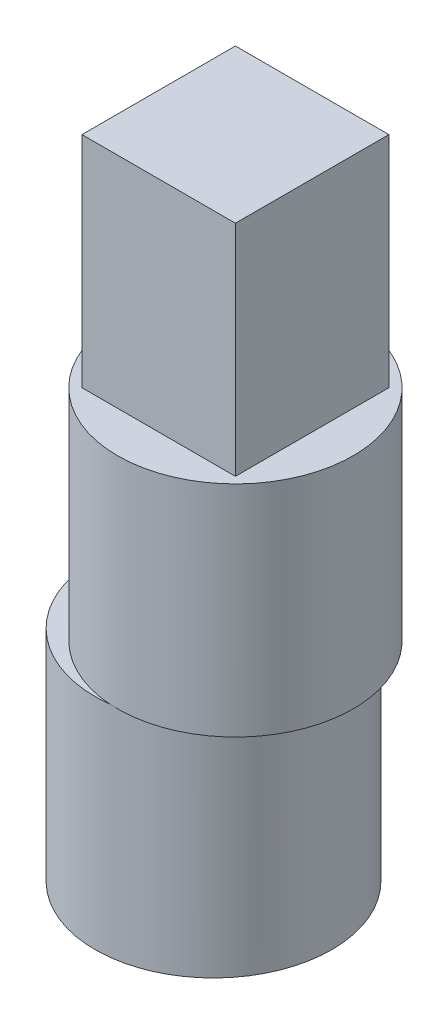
ISO-10303-21;
HEADER;
FILE_DESCRIPTION(('STEP AP214'),'2;1');
FILE_NAME('part.step','',(''),(''),'','','');
FILE_SCHEMA(('AUTOMOTIVE_DESIGN { 1 0 10303 214 1 1 1 1 }'));
ENDSEC;
DATA;
#1=APPLICATION_CONTEXT('core data for automotive mechanical design processes');
#2=APPLICATION_PROTOCOL_DEFINITION('international standard','automotive_design',2000,#1);
#3=PRODUCT_CONTEXT('',#1,'mechanical');
#4=PRODUCT('Part','Part','',(#3));
#5=PRODUCT_RELATED_PRODUCT_CATEGORY('part','',(#4));
#6=PRODUCT_DEFINITION_FORMATION('','',#4);
#7=PRODUCT_DEFINITION_CONTEXT('part definition',#1,'design');
#8=PRODUCT_DEFINITION('design','',#6,#7);
#9=PRODUCT_DEFINITION_SHAPE('','',#8);
#10=(LENGTH_UNIT() NAMED_UNIT(*) SI_UNIT(.MILLI.,.METRE.));
#11=(NAMED_UNIT(*) PLANE_ANGLE_UNIT() SI_UNIT($,.RADIAN.));
#12=(NAMED_UNIT(*) SI_UNIT($,.STERADIAN.) SOLID_ANGLE_UNIT());
#13=UNCERTAINTY_MEASURE_WITH_UNIT(LENGTH_MEASURE(1.E-05),#10,'distance_accuracy_value','');
#14=(GEOMETRIC_REPRESENTATION_CONTEXT(3) GLOBAL_UNCERTAINTY_ASSIGNED_CONTEXT((#13)) GLOBAL_UNIT_ASSIGNED_CONTEXT((#10,
#11,#12)) REPRESENTATION_CONTEXT('',''));
#15=CARTESIAN_POINT('',(0.,0.,0.));
#16=DIRECTION('',(0.,0.,1.));
#17=DIRECTION('',(1.,0.,0.));
#18=AXIS2_PLACEMENT_3D('',#15,#16,#17);
#19=CARTESIAN_POINT('',(0.,10.,0.));
#20=DIRECTION('',(0.,-1.,0.));
#21=DIRECTION('',(0.,0.,-1.));
#22=AXIS2_PLACEMENT_3D('',#19,#20,#21);
#23=CYLINDRICAL_SURFACE('',#22,5.375);
#24=CARTESIAN_POINT('',(0.,10.,0.));
#25=DIRECTION('',(0.,1.,0.));
#26=DIRECTION('',(0.,0.,1.));
#27=AXIS2_PLACEMENT_3D('',#24,#25,#26);
#28=CIRCLE('',#27,5.375);
#29=CARTESIAN_POINT('',(0.,10.,5.375));
#30=VERTEX_POINT('',#29);
#31=EDGE_CURVE('E11',#30,#30,#28,.T.);
#32=ORIENTED_EDGE('',*,*,#31,.F.);
#33=EDGE_LOOP('',(#32));
#34=FACE_BOUND('',#33,.T.);
#35=CARTESIAN_POINT('',(0.,0.,0.));
#36=DIRECTION('',(0.,1.,0.));
#37=DIRECTION('',(0.,0.,1.));
#38=AXIS2_PLACEMENT_3D('',#35,#36,#37);
#39=CIRCLE('',#38,5.375);
#40=CARTESIAN_POINT('',(-0.365312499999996,0.,-5.36257137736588));
#41=VERTEX_POINT('',#40);
#42=CARTESIAN_POINT('',(-0.365312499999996,0.,5.36257137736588));
#43=VERTEX_POINT('',#42);
#44=EDGE_CURVE('E46',#41,#43,#39,.T.);
#45=ORIENTED_EDGE('',*,*,#44,.T.);
#46=EDGE_CURVE('E127',#43,#41,#39,.T.);
#47=ORIENTED_EDGE('',*,*,#46,.T.);
#48=EDGE_LOOP('',(#45,#47));
#49=FACE_BOUND('',#48,.T.);
#50=ADVANCED_FACE('F43',(#34,#49),#23,.T.);
#51=CARTESIAN_POINT('',(0.,10.,0.));
#52=DIRECTION('',(0.,1.,0.));
#53=DIRECTION('',(0.,0.,1.));
#54=AXIS2_PLACEMENT_3D('',#51,#52,#53);
#55=PLANE('',#54);
#56=DIRECTION('',(0.,0.,1.));
#57=VECTOR('',#56,1.);
#58=CARTESIAN_POINT('',(-3.5,10.,-3.5));
#59=LINE('',#58,#57);
#60=CARTESIAN_POINT('',(-3.5,10.,-3.5));
#61=VERTEX_POINT('',#60);
#62=CARTESIAN_POINT('',(-3.5,10.,3.5));
#63=VERTEX_POINT('',#62);
#64=EDGE_CURVE('E58',#61,#63,#59,.T.);
#65=ORIENTED_EDGE('',*,*,#64,.F.);
#66=DIRECTION('',(-1.,0.,0.));
#67=VECTOR('',#66,1.);
#68=CARTESIAN_POINT('',(-3.5,10.,-3.5));
#69=LINE('',#68,#67);
#70=CARTESIAN_POINT('',(3.5,10.,-3.5));
#71=VERTEX_POINT('',#70);
#72=EDGE_CURVE('E62',#71,#61,#69,.T.);
#73=ORIENTED_EDGE('',*,*,#72,.F.);
#74=DIRECTION('',(0.,0.,-1.));
#75=VECTOR('',#74,1.);
#76=CARTESIAN_POINT('',(3.5,10.,-3.5));
#77=LINE('',#76,#75);
#78=CARTESIAN_POINT('',(3.5,10.,3.5));
#79=VERTEX_POINT('',#78);
#80=EDGE_CURVE('E267',#79,#71,#77,.T.);
#81=ORIENTED_EDGE('',*,*,#80,.F.);
#82=DIRECTION('',(1.,0.,0.));
#83=VECTOR('',#82,1.);
#84=CARTESIAN_POINT('',(-3.5,10.,3.5));
#85=LINE('',#84,#83);
#86=EDGE_CURVE('E277',#63,#79,#85,.T.);
#87=ORIENTED_EDGE('',*,*,#86,.F.);
#88=EDGE_LOOP('',(#65,#73,#81,#87));
#89=FACE_BOUND('',#88,.T.);
#90=ORIENTED_EDGE('',*,*,#31,.T.);
#91=EDGE_LOOP('',(#90));
#92=FACE_BOUND('',#91,.T.);
#93=ADVANCED_FACE('F155',(#89,#92),#55,.T.);
#94=CARTESIAN_POINT('',(0.,0.,0.));
#95=DIRECTION('',(0.,1.,0.));
#96=DIRECTION('',(0.,0.,1.));
#97=AXIS2_PLACEMENT_3D('',#94,#95,#96);
#98=PLANE('',#97);
#99=CARTESIAN_POINT('',(-1.,0.,0.));
#100=DIRECTION('',(0.,-1.,0.));
#101=DIRECTION('',(0.,0.,-1.));
#102=AXIS2_PLACEMENT_3D('',#99,#100,#101);
#103=CIRCLE('',#102,5.4);
#104=EDGE_CURVE('E118',#41,#43,#103,.T.);
#105=ORIENTED_EDGE('',*,*,#104,.F.);
#106=ORIENTED_EDGE('',*,*,#46,.F.);
#107=EDGE_LOOP('',(#105,#106));
#108=FACE_BOUND('',#107,.T.);
#109=ADVANCED_FACE('F136',(#108),#98,.F.);
#110=CARTESIAN_POINT('',(-1.,-10.,0.));
#111=DIRECTION('',(0.,1.,0.));
#112=DIRECTION('',(0.,0.,1.));
#113=AXIS2_PLACEMENT_3D('',#110,#111,#112);
#114=CYLINDRICAL_SURFACE('',#113,5.4);
#115=CARTESIAN_POINT('',(-1.,-10.,0.));
#116=DIRECTION('',(0.,-1.,0.));
#117=DIRECTION('',(0.,0.,-1.));
#118=AXIS2_PLACEMENT_3D('',#115,#116,#117);
#119=CIRCLE('',#118,5.4);
#120=CARTESIAN_POINT('',(-1.,-10.,-5.4));
#121=VERTEX_POINT('',#120);
#122=EDGE_CURVE('E124',#121,#121,#119,.T.);
#123=ORIENTED_EDGE('',*,*,#122,.F.);
#124=EDGE_LOOP('',(#123));
#125=FACE_BOUND('',#124,.T.);
#126=ORIENTED_EDGE('',*,*,#104,.T.);
#127=EDGE_CURVE('E113',#43,#41,#103,.T.);
#128=ORIENTED_EDGE('',*,*,#127,.T.);
#129=EDGE_LOOP('',(#126,#128));
#130=FACE_BOUND('',#129,.T.);
#131=ADVANCED_FACE('F131',(#125,#130),#114,.T.);
#132=CARTESIAN_POINT('',(-1.,-10.,0.));
#133=DIRECTION('',(0.,-1.,0.));
#134=DIRECTION('',(0.,0.,-1.));
#135=AXIS2_PLACEMENT_3D('',#132,#133,#134);
#136=PLANE('',#135);
#137=ORIENTED_EDGE('',*,*,#122,.T.);
#138=EDGE_LOOP('',(#137));
#139=FACE_BOUND('',#138,.T.);
#140=ADVANCED_FACE('F144',(#139),#136,.T.);
#141=CARTESIAN_POINT('',(-1.,0.,0.));
#142=DIRECTION('',(0.,-1.,0.));
#143=DIRECTION('',(0.,0.,-1.));
#144=AXIS2_PLACEMENT_3D('',#141,#142,#143);
#145=PLANE('',#144);
#146=ORIENTED_EDGE('',*,*,#44,.F.);
#147=ORIENTED_EDGE('',*,*,#127,.F.);
#148=EDGE_LOOP('',(#146,#147));
#149=FACE_BOUND('',#148,.T.);
#150=ADVANCED_FACE('F141',(#149),#145,.F.);
#151=CARTESIAN_POINT('',(-3.5,20.,-3.5));
#152=DIRECTION('',(1.,0.,0.));
#153=DIRECTION('',(0.,0.,-1.));
#154=AXIS2_PLACEMENT_3D('',#151,#152,#153);
#155=PLANE('',#154);
#156=ORIENTED_EDGE('',*,*,#64,.T.);
#157=DIRECTION('',(0.,-1.,0.));
#158=VECTOR('',#157,1.);
#159=CARTESIAN_POINT('',(-3.5,20.,3.5));
#160=LINE('',#159,#158);
#161=CARTESIAN_POINT('',(-3.5,20.,3.5));
#162=VERTEX_POINT('',#161);
#163=EDGE_CURVE('E93',#162,#63,#160,.T.);
#164=ORIENTED_EDGE('',*,*,#163,.F.);
#165=DIRECTION('',(0.,0.,1.));
#166=VECTOR('',#165,1.);
#167=CARTESIAN_POINT('',(-3.5,20.,-3.5));
#168=LINE('',#167,#166);
#169=CARTESIAN_POINT('',(-3.5,20.,-3.5));
#170=VERTEX_POINT('',#169);
#171=EDGE_CURVE('E100',#170,#162,#168,.T.);
#172=ORIENTED_EDGE('',*,*,#171,.F.);
#173=DIRECTION('',(0.,-1.,0.));
#174=VECTOR('',#173,1.);
#175=CARTESIAN_POINT('',(-3.5,20.,-3.5));
#176=LINE('',#175,#174);
#177=EDGE_CURVE('E264',#170,#61,#176,.T.);
#178=ORIENTED_EDGE('',*,*,#177,.T.);
#179=EDGE_LOOP('',(#156,#164,#172,#178));
#180=FACE_BOUND('',#179,.T.);
#181=ADVANCED_FACE('F111',(#180),#155,.F.);
#182=CARTESIAN_POINT('',(-3.5,20.,3.5));
#183=DIRECTION('',(0.,0.,-1.));
#184=DIRECTION('',(-1.,0.,0.));
#185=AXIS2_PLACEMENT_3D('',#182,#183,#184);
#186=PLANE('',#185);
#187=ORIENTED_EDGE('',*,*,#86,.T.);
#188=DIRECTION('',(0.,-1.,0.));
#189=VECTOR('',#188,1.);
#190=CARTESIAN_POINT('',(3.5,20.,3.5));
#191=LINE('',#190,#189);
#192=CARTESIAN_POINT('',(3.5,20.,3.5));
#193=VERTEX_POINT('',#192);
#194=EDGE_CURVE('E95',#193,#79,#191,.T.);
#195=ORIENTED_EDGE('',*,*,#194,.F.);
#196=DIRECTION('',(1.,0.,0.));
#197=VECTOR('',#196,1.);
#198=CARTESIAN_POINT('',(-3.5,20.,3.5));
#199=LINE('',#198,#197);
#200=EDGE_CURVE('E88',#162,#193,#199,.T.);
#201=ORIENTED_EDGE('',*,*,#200,.F.);
#202=ORIENTED_EDGE('',*,*,#163,.T.);
#203=EDGE_LOOP('',(#187,#195,#201,#202));
#204=FACE_BOUND('',#203,.T.);
#205=ADVANCED_FACE('F91',(#204),#186,.F.);
#206=CARTESIAN_POINT('',(3.5,20.,-3.5));
#207=DIRECTION('',(-1.,0.,0.));
#208=DIRECTION('',(0.,0.,1.));
#209=AXIS2_PLACEMENT_3D('',#206,#207,#208);
#210=PLANE('',#209);
#211=ORIENTED_EDGE('',*,*,#80,.T.);
#212=DIRECTION('',(0.,-1.,0.));
#213=VECTOR('',#212,1.);
#214=CARTESIAN_POINT('',(3.5,20.,-3.5));
#215=LINE('',#214,#213);
#216=CARTESIAN_POINT('',(3.5,20.,-3.5));
#217=VERTEX_POINT('',#216);
#218=EDGE_CURVE('E120',#217,#71,#215,.T.);
#219=ORIENTED_EDGE('',*,*,#218,.F.);
#220=DIRECTION('',(0.,0.,-1.));
#221=VECTOR('',#220,1.);
#222=CARTESIAN_POINT('',(3.5,20.,-3.5));
#223=LINE('',#222,#221);
#224=EDGE_CURVE('E99',#193,#217,#223,.T.);
#225=ORIENTED_EDGE('',*,*,#224,.F.);
#226=ORIENTED_EDGE('',*,*,#194,.T.);
#227=EDGE_LOOP('',(#211,#219,#225,#226));
#228=FACE_BOUND('',#227,.T.);
#229=ADVANCED_FACE('F206',(#228),#210,.F.);
#230=CARTESIAN_POINT('',(-3.5,20.,-3.5));
#231=DIRECTION('',(0.,0.,1.));
#232=DIRECTION('',(1.,0.,0.));
#233=AXIS2_PLACEMENT_3D('',#230,#231,#232);
#234=PLANE('',#233);
#235=ORIENTED_EDGE('',*,*,#72,.T.);
#236=ORIENTED_EDGE('',*,*,#177,.F.);
#237=DIRECTION('',(-1.,0.,0.));
#238=VECTOR('',#237,1.);
#239=CARTESIAN_POINT('',(-3.5,20.,-3.5));
#240=LINE('',#239,#238);
#241=EDGE_CURVE('E105',#217,#170,#240,.T.);
#242=ORIENTED_EDGE('',*,*,#241,.F.);
#243=ORIENTED_EDGE('',*,*,#218,.T.);
#244=EDGE_LOOP('',(#235,#236,#242,#243));
#245=FACE_BOUND('',#244,.T.);
#246=ADVANCED_FACE('F216',(#245),#234,.F.);
#247=CARTESIAN_POINT('',(0.,20.,0.));
#248=DIRECTION('',(0.,1.,0.));
#249=DIRECTION('',(0.,0.,1.));
#250=AXIS2_PLACEMENT_3D('',#247,#248,#249);
#251=PLANE('',#250);
#252=ORIENTED_EDGE('',*,*,#171,.T.);
#253=ORIENTED_EDGE('',*,*,#200,.T.);
#254=ORIENTED_EDGE('',*,*,#224,.T.);
#255=ORIENTED_EDGE('',*,*,#241,.T.);
#256=EDGE_LOOP('',(#252,#253,#254,#255));
#257=FACE_BOUND('',#256,.T.);
#258=ADVANCED_FACE('F103',(#257),#251,.T.);
#259=CLOSED_SHELL('',(#50,#93,#109,#131,#140,#150,#181,#205,#229,#246,#258));
#260=MANIFOLD_SOLID_BREP('B2',#259);
#261=ADVANCED_BREP_SHAPE_REPRESENTATION('',(#18,#260),#14);
#262=SHAPE_DEFINITION_REPRESENTATION(#9,#261);
ENDSEC;
END-ISO-10303-21;
